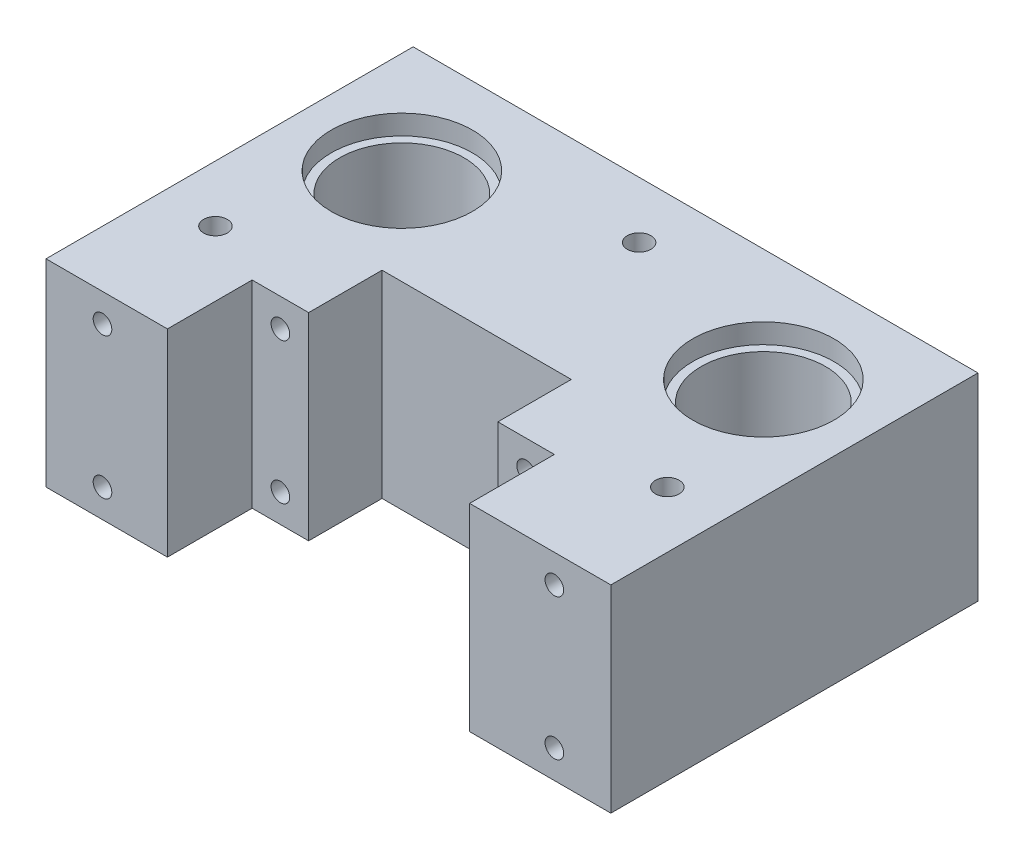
ISO-10303-21;
HEADER;
FILE_DESCRIPTION(('STEP AP214'),'2;1');
FILE_NAME('part.step','',(''),(''),'','','');
FILE_SCHEMA(('AUTOMOTIVE_DESIGN { 1 0 10303 214 1 1 1 1 }'));
ENDSEC;
DATA;
#1=APPLICATION_CONTEXT('core data for automotive mechanical design processes');
#2=APPLICATION_PROTOCOL_DEFINITION('international standard','automotive_design',2000,#1);
#3=PRODUCT_CONTEXT('',#1,'mechanical');
#4=PRODUCT('Part','Part','',(#3));
#5=PRODUCT_RELATED_PRODUCT_CATEGORY('part','',(#4));
#6=PRODUCT_DEFINITION_FORMATION('','',#4);
#7=PRODUCT_DEFINITION_CONTEXT('part definition',#1,'design');
#8=PRODUCT_DEFINITION('design','',#6,#7);
#9=PRODUCT_DEFINITION_SHAPE('','',#8);
#10=(LENGTH_UNIT() NAMED_UNIT(*) SI_UNIT(.MILLI.,.METRE.));
#11=(NAMED_UNIT(*) PLANE_ANGLE_UNIT() SI_UNIT($,.RADIAN.));
#12=(NAMED_UNIT(*) SI_UNIT($,.STERADIAN.) SOLID_ANGLE_UNIT());
#13=UNCERTAINTY_MEASURE_WITH_UNIT(LENGTH_MEASURE(1.E-05),#10,'distance_accuracy_value','');
#14=(GEOMETRIC_REPRESENTATION_CONTEXT(3) GLOBAL_UNCERTAINTY_ASSIGNED_CONTEXT((#13)) GLOBAL_UNIT_ASSIGNED_CONTEXT((#10,
#11,#12)) REPRESENTATION_CONTEXT('',''));
#15=CARTESIAN_POINT('',(0.,0.,0.));
#16=DIRECTION('',(0.,0.,1.));
#17=DIRECTION('',(1.,0.,0.));
#18=AXIS2_PLACEMENT_3D('',#15,#16,#17);
#19=CARTESIAN_POINT('',(82.,-30.,20.));
#20=DIRECTION('',(0.,1.,0.));
#21=DIRECTION('',(0.,0.,1.));
#22=AXIS2_PLACEMENT_3D('',#19,#20,#21);
#23=CYLINDRICAL_SURFACE('',#22,11.);
#24=CARTESIAN_POINT('',(82.,0.,20.));
#25=DIRECTION('',(0.,1.,0.));
#26=DIRECTION('',(0.,0.,1.));
#27=AXIS2_PLACEMENT_3D('',#24,#25,#26);
#28=CIRCLE('',#27,11.);
#29=CARTESIAN_POINT('',(82.,0.,31.));
#30=VERTEX_POINT('',#29);
#31=EDGE_CURVE('E192',#30,#30,#28,.T.);
#32=ORIENTED_EDGE('',*,*,#31,.F.);
#33=EDGE_LOOP('',(#32));
#34=FACE_BOUND('',#33,.T.);
#35=CARTESIAN_POINT('',(82.,31.5,20.));
#36=DIRECTION('',(0.,1.,0.));
#37=DIRECTION('',(0.,0.,1.));
#38=AXIS2_PLACEMENT_3D('',#35,#36,#37);
#39=CIRCLE('',#38,11.);
#40=CARTESIAN_POINT('',(82.,31.5,31.));
#41=VERTEX_POINT('',#40);
#42=EDGE_CURVE('E37',#41,#41,#39,.F.);
#43=ORIENTED_EDGE('',*,*,#42,.F.);
#44=EDGE_LOOP('',(#43));
#45=FACE_BOUND('',#44,.T.);
#46=ADVANCED_FACE('F33',(#34,#45),#23,.F.);
#47=CARTESIAN_POINT('',(18.,-30.,20.));
#48=DIRECTION('',(0.,1.,0.));
#49=DIRECTION('',(0.,0.,1.));
#50=AXIS2_PLACEMENT_3D('',#47,#48,#49);
#51=CYLINDRICAL_SURFACE('',#50,11.);
#52=CARTESIAN_POINT('',(18.,0.,20.));
#53=DIRECTION('',(0.,1.,0.));
#54=DIRECTION('',(0.,0.,1.));
#55=AXIS2_PLACEMENT_3D('',#52,#53,#54);
#56=CIRCLE('',#55,11.);
#57=CARTESIAN_POINT('',(18.,0.,31.));
#58=VERTEX_POINT('',#57);
#59=EDGE_CURVE('E195',#58,#58,#56,.T.);
#60=ORIENTED_EDGE('',*,*,#59,.F.);
#61=EDGE_LOOP('',(#60));
#62=FACE_BOUND('',#61,.T.);
#63=CARTESIAN_POINT('',(18.,31.5,20.));
#64=DIRECTION('',(0.,1.,0.));
#65=DIRECTION('',(0.,0.,1.));
#66=AXIS2_PLACEMENT_3D('',#63,#64,#65);
#67=CIRCLE('',#66,11.);
#68=CARTESIAN_POINT('',(18.,31.5,31.));
#69=VERTEX_POINT('',#68);
#70=EDGE_CURVE('E151',#69,#69,#67,.F.);
#71=ORIENTED_EDGE('',*,*,#70,.F.);
#72=EDGE_LOOP('',(#71));
#73=FACE_BOUND('',#72,.T.);
#74=ADVANCED_FACE('F255',(#62,#73),#51,.F.);
#75=CARTESIAN_POINT('',(0.,0.,65.));
#76=DIRECTION('',(0.,1.,0.));
#77=DIRECTION('',(0.,0.,1.));
#78=AXIS2_PLACEMENT_3D('',#75,#76,#77);
#79=PLANE('',#78);
#80=CARTESIAN_POINT('',(59.9975000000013,0.,32.5));
#81=DIRECTION('',(0.,-1.,0.));
#82=DIRECTION('',(0.,0.,-1.));
#83=AXIS2_PLACEMENT_3D('',#80,#81,#82);
#84=CIRCLE('',#83,1.65);
#85=CARTESIAN_POINT('',(59.9975000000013,0.,30.85));
#86=VERTEX_POINT('',#85);
#87=EDGE_CURVE('E443',#86,#86,#84,.T.);
#88=ORIENTED_EDGE('',*,*,#87,.F.);
#89=EDGE_LOOP('',(#88));
#90=FACE_BOUND('',#89,.T.);
#91=CARTESIAN_POINT('',(36.4975000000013,0.,32.5));
#92=DIRECTION('',(0.,-1.,0.));
#93=DIRECTION('',(0.,0.,-1.));
#94=AXIS2_PLACEMENT_3D('',#91,#92,#93);
#95=CIRCLE('',#94,1.65);
#96=CARTESIAN_POINT('',(36.4975000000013,0.,30.85));
#97=VERTEX_POINT('',#96);
#98=EDGE_CURVE('E442',#97,#97,#95,.T.);
#99=ORIENTED_EDGE('',*,*,#98,.F.);
#100=EDGE_LOOP('',(#99));
#101=FACE_BOUND('',#100,.T.);
#102=ORIENTED_EDGE('',*,*,#59,.T.);
#103=EDGE_LOOP('',(#102));
#104=FACE_BOUND('',#103,.T.);
#105=ORIENTED_EDGE('',*,*,#31,.T.);
#106=EDGE_LOOP('',(#105));
#107=FACE_BOUND('',#106,.T.);
#108=DIRECTION('',(-1.21199346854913E-13,0.,1.));
#109=VECTOR('',#108,1.);
#110=CARTESIAN_POINT('',(74.9974999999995,0.,65.0000000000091));
#111=LINE('',#110,#109);
#112=CARTESIAN_POINT('',(74.9975000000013,0.,50.));
#113=VERTEX_POINT('',#112);
#114=CARTESIAN_POINT('',(74.9974999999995,0.,65.));
#115=VERTEX_POINT('',#114);
#116=EDGE_CURVE('E180',#113,#115,#111,.T.);
#117=ORIENTED_EDGE('',*,*,#116,.F.);
#118=DIRECTION('',(1.,0.,0.));
#119=VECTOR('',#118,1.);
#120=CARTESIAN_POINT('',(0.,0.,50.));
#121=LINE('',#120,#119);
#122=CARTESIAN_POINT('',(64.9975000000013,0.,50.));
#123=VERTEX_POINT('',#122);
#124=EDGE_CURVE('E190',#123,#113,#121,.T.);
#125=ORIENTED_EDGE('',*,*,#124,.F.);
#126=DIRECTION('',(0.,0.,1.));
#127=VECTOR('',#126,1.);
#128=CARTESIAN_POINT('',(64.9975000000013,0.,65.));
#129=LINE('',#128,#127);
#130=CARTESIAN_POINT('',(64.9975000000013,0.,37.));
#131=VERTEX_POINT('',#130);
#132=EDGE_CURVE('E188',#131,#123,#129,.T.);
#133=ORIENTED_EDGE('',*,*,#132,.F.);
#134=DIRECTION('',(1.,0.,0.));
#135=VECTOR('',#134,1.);
#136=CARTESIAN_POINT('',(0.,0.,37.));
#137=LINE('',#136,#135);
#138=CARTESIAN_POINT('',(31.4975000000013,0.,37.));
#139=VERTEX_POINT('',#138);
#140=EDGE_CURVE('E186',#139,#131,#137,.T.);
#141=ORIENTED_EDGE('',*,*,#140,.F.);
#142=DIRECTION('',(0.,0.,-1.));
#143=VECTOR('',#142,1.);
#144=CARTESIAN_POINT('',(31.4975000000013,0.,65.));
#145=LINE('',#144,#143);
#146=CARTESIAN_POINT('',(31.4975000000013,0.,50.));
#147=VERTEX_POINT('',#146);
#148=EDGE_CURVE('E184',#147,#139,#145,.T.);
#149=ORIENTED_EDGE('',*,*,#148,.F.);
#150=DIRECTION('',(1.,0.,0.));
#151=VECTOR('',#150,1.);
#152=CARTESIAN_POINT('',(0.,0.,50.));
#153=LINE('',#152,#151);
#154=CARTESIAN_POINT('',(21.4975000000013,0.,50.));
#155=VERTEX_POINT('',#154);
#156=EDGE_CURVE('E182',#155,#147,#153,.T.);
#157=ORIENTED_EDGE('',*,*,#156,.F.);
#158=DIRECTION('',(0.,0.,-1.));
#159=VECTOR('',#158,1.);
#160=CARTESIAN_POINT('',(21.4975000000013,0.,65.));
#161=LINE('',#160,#159);
#162=CARTESIAN_POINT('',(21.4975000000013,0.,65.));
#163=VERTEX_POINT('',#162);
#164=EDGE_CURVE('E135',#163,#155,#161,.T.);
#165=ORIENTED_EDGE('',*,*,#164,.F.);
#166=DIRECTION('',(1.,0.,0.));
#167=VECTOR('',#166,1.);
#168=CARTESIAN_POINT('',(0.,0.,65.));
#169=LINE('',#168,#167);
#170=CARTESIAN_POINT('',(0.,0.,65.));
#171=VERTEX_POINT('',#170);
#172=EDGE_CURVE('E88',#171,#163,#169,.T.);
#173=ORIENTED_EDGE('',*,*,#172,.F.);
#174=DIRECTION('',(0.,0.,-1.));
#175=VECTOR('',#174,1.);
#176=CARTESIAN_POINT('',(0.,0.,65.));
#177=LINE('',#176,#175);
#178=CARTESIAN_POINT('',(0.,0.,0.));
#179=VERTEX_POINT('',#178);
#180=EDGE_CURVE('E222',#171,#179,#177,.T.);
#181=ORIENTED_EDGE('',*,*,#180,.T.);
#182=DIRECTION('',(1.,0.,0.));
#183=VECTOR('',#182,1.);
#184=CARTESIAN_POINT('',(0.,0.,0.));
#185=LINE('',#184,#183);
#186=CARTESIAN_POINT('',(100.,0.,0.));
#187=VERTEX_POINT('',#186);
#188=EDGE_CURVE('E211',#179,#187,#185,.T.);
#189=ORIENTED_EDGE('',*,*,#188,.T.);
#190=DIRECTION('',(0.,0.,-1.));
#191=VECTOR('',#190,1.);
#192=CARTESIAN_POINT('',(100.,0.,65.));
#193=LINE('',#192,#191);
#194=CARTESIAN_POINT('',(100.,0.,65.));
#195=VERTEX_POINT('',#194);
#196=EDGE_CURVE('E219',#195,#187,#193,.T.);
#197=ORIENTED_EDGE('',*,*,#196,.F.);
#198=EDGE_CURVE('E201',#115,#195,#169,.T.);
#199=ORIENTED_EDGE('',*,*,#198,.F.);
#200=EDGE_LOOP('',(#117,#125,#133,#141,#149,#157,#165,#173,#181,#189,#197,#199));
#201=FACE_BOUND('',#200,.T.);
#202=ADVANCED_FACE('F225',(#90,#101,#104,#107,#201),#79,.F.);
#203=CARTESIAN_POINT('',(0.,35.,65.));
#204=DIRECTION('',(0.,-1.,0.));
#205=DIRECTION('',(0.,0.,-1.));
#206=AXIS2_PLACEMENT_3D('',#203,#204,#205);
#207=PLANE('',#206);
#208=CARTESIAN_POINT('',(90.,35.,45.));
#209=DIRECTION('',(0.,1.,0.));
#210=DIRECTION('',(0.,0.,1.));
#211=AXIS2_PLACEMENT_3D('',#208,#209,#210);
#212=CIRCLE('',#211,2.1);
#213=CARTESIAN_POINT('',(90.,35.,47.1));
#214=VERTEX_POINT('',#213);
#215=EDGE_CURVE('E495',#214,#214,#212,.T.);
#216=ORIENTED_EDGE('',*,*,#215,.F.);
#217=EDGE_LOOP('',(#216));
#218=FACE_BOUND('',#217,.T.);
#219=CARTESIAN_POINT('',(10.,35.,45.));
#220=DIRECTION('',(0.,1.,0.));
#221=DIRECTION('',(0.,0.,1.));
#222=AXIS2_PLACEMENT_3D('',#219,#220,#221);
#223=CIRCLE('',#222,2.1);
#224=CARTESIAN_POINT('',(10.,35.,47.1));
#225=VERTEX_POINT('',#224);
#226=EDGE_CURVE('E501',#225,#225,#223,.T.);
#227=ORIENTED_EDGE('',*,*,#226,.F.);
#228=EDGE_LOOP('',(#227));
#229=FACE_BOUND('',#228,.T.);
#230=CARTESIAN_POINT('',(50.,35.,10.));
#231=DIRECTION('',(0.,1.,0.));
#232=DIRECTION('',(0.,0.,1.));
#233=AXIS2_PLACEMENT_3D('',#230,#231,#232);
#234=CIRCLE('',#233,2.1);
#235=CARTESIAN_POINT('',(50.,35.,12.1));
#236=VERTEX_POINT('',#235);
#237=EDGE_CURVE('E507',#236,#236,#234,.T.);
#238=ORIENTED_EDGE('',*,*,#237,.F.);
#239=EDGE_LOOP('',(#238));
#240=FACE_BOUND('',#239,.T.);
#241=CARTESIAN_POINT('',(82.,35.,20.));
#242=DIRECTION('',(0.,1.,0.));
#243=DIRECTION('',(0.,0.,1.));
#244=AXIS2_PLACEMENT_3D('',#241,#242,#243);
#245=CIRCLE('',#244,12.5);
#246=CARTESIAN_POINT('',(82.,35.,32.5));
#247=VERTEX_POINT('',#246);
#248=EDGE_CURVE('E513',#247,#247,#245,.T.);
#249=ORIENTED_EDGE('',*,*,#248,.F.);
#250=EDGE_LOOP('',(#249));
#251=FACE_BOUND('',#250,.T.);
#252=CARTESIAN_POINT('',(18.,35.,20.));
#253=DIRECTION('',(0.,1.,0.));
#254=DIRECTION('',(0.,0.,1.));
#255=AXIS2_PLACEMENT_3D('',#252,#253,#254);
#256=CIRCLE('',#255,12.5);
#257=CARTESIAN_POINT('',(18.,35.,32.5));
#258=VERTEX_POINT('',#257);
#259=EDGE_CURVE('E156',#258,#258,#256,.T.);
#260=ORIENTED_EDGE('',*,*,#259,.F.);
#261=EDGE_LOOP('',(#260));
#262=FACE_BOUND('',#261,.T.);
#263=DIRECTION('',(-1.21199346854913E-13,0.,1.));
#264=VECTOR('',#263,1.);
#265=CARTESIAN_POINT('',(74.9974999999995,35.,65.));
#266=LINE('',#265,#264);
#267=CARTESIAN_POINT('',(74.9975000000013,35.,50.));
#268=VERTEX_POINT('',#267);
#269=CARTESIAN_POINT('',(74.9974999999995,35.,65.));
#270=VERTEX_POINT('',#269);
#271=EDGE_CURVE('E139',#268,#270,#266,.T.);
#272=ORIENTED_EDGE('',*,*,#271,.T.);
#273=DIRECTION('',(-1.,0.,0.));
#274=VECTOR('',#273,1.);
#275=CARTESIAN_POINT('',(0.,35.,65.));
#276=LINE('',#275,#274);
#277=CARTESIAN_POINT('',(100.,35.,65.));
#278=VERTEX_POINT('',#277);
#279=EDGE_CURVE('E205',#278,#270,#276,.T.);
#280=ORIENTED_EDGE('',*,*,#279,.F.);
#281=DIRECTION('',(0.,0.,-1.));
#282=VECTOR('',#281,1.);
#283=CARTESIAN_POINT('',(100.,35.,65.));
#284=LINE('',#283,#282);
#285=CARTESIAN_POINT('',(100.,35.,0.));
#286=VERTEX_POINT('',#285);
#287=EDGE_CURVE('E217',#278,#286,#284,.T.);
#288=ORIENTED_EDGE('',*,*,#287,.T.);
#289=DIRECTION('',(-1.,0.,0.));
#290=VECTOR('',#289,1.);
#291=CARTESIAN_POINT('',(0.,35.,0.));
#292=LINE('',#291,#290);
#293=CARTESIAN_POINT('',(0.,35.,0.));
#294=VERTEX_POINT('',#293);
#295=EDGE_CURVE('E80',#286,#294,#292,.T.);
#296=ORIENTED_EDGE('',*,*,#295,.T.);
#297=DIRECTION('',(0.,0.,-1.));
#298=VECTOR('',#297,1.);
#299=CARTESIAN_POINT('',(0.,35.,65.));
#300=LINE('',#299,#298);
#301=CARTESIAN_POINT('',(0.,35.,65.));
#302=VERTEX_POINT('',#301);
#303=EDGE_CURVE('E208',#302,#294,#300,.T.);
#304=ORIENTED_EDGE('',*,*,#303,.F.);
#305=CARTESIAN_POINT('',(21.4975000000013,35.,65.));
#306=VERTEX_POINT('',#305);
#307=EDGE_CURVE('E58',#306,#302,#276,.T.);
#308=ORIENTED_EDGE('',*,*,#307,.F.);
#309=DIRECTION('',(0.,0.,-1.));
#310=VECTOR('',#309,1.);
#311=CARTESIAN_POINT('',(21.4975000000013,35.,65.));
#312=LINE('',#311,#310);
#313=CARTESIAN_POINT('',(21.4975000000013,35.,50.));
#314=VERTEX_POINT('',#313);
#315=EDGE_CURVE('E50',#306,#314,#312,.T.);
#316=ORIENTED_EDGE('',*,*,#315,.T.);
#317=DIRECTION('',(1.,0.,0.));
#318=VECTOR('',#317,1.);
#319=CARTESIAN_POINT('',(21.4975000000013,35.,50.));
#320=LINE('',#319,#318);
#321=CARTESIAN_POINT('',(31.4975000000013,35.,50.));
#322=VERTEX_POINT('',#321);
#323=EDGE_CURVE('E142',#314,#322,#320,.T.);
#324=ORIENTED_EDGE('',*,*,#323,.T.);
#325=DIRECTION('',(0.,0.,-1.));
#326=VECTOR('',#325,1.);
#327=CARTESIAN_POINT('',(31.4975000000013,35.,50.));
#328=LINE('',#327,#326);
#329=CARTESIAN_POINT('',(31.4975000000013,35.,37.));
#330=VERTEX_POINT('',#329);
#331=EDGE_CURVE('E147',#322,#330,#328,.T.);
#332=ORIENTED_EDGE('',*,*,#331,.T.);
#333=DIRECTION('',(1.,0.,0.));
#334=VECTOR('',#333,1.);
#335=CARTESIAN_POINT('',(31.4975000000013,35.,37.));
#336=LINE('',#335,#334);
#337=CARTESIAN_POINT('',(64.9975000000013,35.,37.));
#338=VERTEX_POINT('',#337);
#339=EDGE_CURVE('E160',#330,#338,#336,.T.);
#340=ORIENTED_EDGE('',*,*,#339,.T.);
#341=DIRECTION('',(0.,0.,1.));
#342=VECTOR('',#341,1.);
#343=CARTESIAN_POINT('',(64.9975000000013,35.,50.));
#344=LINE('',#343,#342);
#345=CARTESIAN_POINT('',(64.9975000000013,35.,50.));
#346=VERTEX_POINT('',#345);
#347=EDGE_CURVE('E163',#338,#346,#344,.T.);
#348=ORIENTED_EDGE('',*,*,#347,.T.);
#349=DIRECTION('',(1.,0.,0.));
#350=VECTOR('',#349,1.);
#351=CARTESIAN_POINT('',(64.9975000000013,35.,50.));
#352=LINE('',#351,#350);
#353=EDGE_CURVE('E166',#346,#268,#352,.T.);
#354=ORIENTED_EDGE('',*,*,#353,.T.);
#355=EDGE_LOOP('',(#272,#280,#288,#296,#304,#308,#316,#324,#332,#340,#348,#354));
#356=FACE_BOUND('',#355,.T.);
#357=ADVANCED_FACE('F150',(#218,#229,#240,#251,#262,#356),#207,.F.);
#358=CARTESIAN_POINT('',(0.,35.,65.));
#359=DIRECTION('',(0.,0.,-1.));
#360=DIRECTION('',(-1.,0.,0.));
#361=AXIS2_PLACEMENT_3D('',#358,#359,#360);
#362=PLANE('',#361);
#363=CARTESIAN_POINT('',(90.,5.,65.));
#364=DIRECTION('',(0.,0.,1.));
#365=DIRECTION('',(1.,0.,0.));
#366=AXIS2_PLACEMENT_3D('',#363,#364,#365);
#367=CIRCLE('',#366,1.65);
#368=CARTESIAN_POINT('',(91.65,5.,65.));
#369=VERTEX_POINT('',#368);
#370=EDGE_CURVE('E279',#369,#369,#367,.T.);
#371=ORIENTED_EDGE('',*,*,#370,.F.);
#372=EDGE_LOOP('',(#371));
#373=FACE_BOUND('',#372,.T.);
#374=CARTESIAN_POINT('',(90.,30.,65.));
#375=DIRECTION('',(0.,0.,1.));
#376=DIRECTION('',(1.,0.,0.));
#377=AXIS2_PLACEMENT_3D('',#374,#375,#376);
#378=CIRCLE('',#377,1.65);
#379=CARTESIAN_POINT('',(91.65,30.,65.));
#380=VERTEX_POINT('',#379);
#381=EDGE_CURVE('E283',#380,#380,#378,.T.);
#382=ORIENTED_EDGE('',*,*,#381,.F.);
#383=EDGE_LOOP('',(#382));
#384=FACE_BOUND('',#383,.T.);
#385=DIRECTION('',(0.,1.,0.));
#386=VECTOR('',#385,1.);
#387=CARTESIAN_POINT('',(74.9974999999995,35.,65.));
#388=LINE('',#387,#386);
#389=EDGE_CURVE('E12',#115,#270,#388,.T.);
#390=ORIENTED_EDGE('',*,*,#389,.F.);
#391=ORIENTED_EDGE('',*,*,#198,.T.);
#392=DIRECTION('',(0.,1.,0.));
#393=VECTOR('',#392,1.);
#394=CARTESIAN_POINT('',(100.,0.,65.));
#395=LINE('',#394,#393);
#396=EDGE_CURVE('E203',#195,#278,#395,.T.);
#397=ORIENTED_EDGE('',*,*,#396,.T.);
#398=ORIENTED_EDGE('',*,*,#279,.T.);
#399=EDGE_LOOP('',(#390,#391,#397,#398));
#400=FACE_BOUND('',#399,.T.);
#401=ADVANCED_FACE('F267',(#373,#384,#400),#362,.F.);
#402=CARTESIAN_POINT('',(10.,30.,65.));
#403=DIRECTION('',(0.,0.,1.));
#404=DIRECTION('',(1.,0.,0.));
#405=AXIS2_PLACEMENT_3D('',#402,#403,#404);
#406=CIRCLE('',#405,1.65);
#407=CARTESIAN_POINT('',(11.65,30.,65.));
#408=VERTEX_POINT('',#407);
#409=EDGE_CURVE('E452',#408,#408,#406,.T.);
#410=ORIENTED_EDGE('',*,*,#409,.F.);
#411=EDGE_LOOP('',(#410));
#412=FACE_BOUND('',#411,.T.);
#413=CARTESIAN_POINT('',(10.,5.,65.));
#414=DIRECTION('',(0.,0.,1.));
#415=DIRECTION('',(1.,0.,0.));
#416=AXIS2_PLACEMENT_3D('',#413,#414,#415);
#417=CIRCLE('',#416,1.65);
#418=CARTESIAN_POINT('',(11.65,5.,65.));
#419=VERTEX_POINT('',#418);
#420=EDGE_CURVE('E457',#419,#419,#417,.T.);
#421=ORIENTED_EDGE('',*,*,#420,.F.);
#422=EDGE_LOOP('',(#421));
#423=FACE_BOUND('',#422,.T.);
#424=DIRECTION('',(0.,-1.,0.));
#425=VECTOR('',#424,1.);
#426=CARTESIAN_POINT('',(21.4975000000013,35.,65.));
#427=LINE('',#426,#425);
#428=EDGE_CURVE('E42',#306,#163,#427,.T.);
#429=ORIENTED_EDGE('',*,*,#428,.F.);
#430=ORIENTED_EDGE('',*,*,#307,.T.);
#431=DIRECTION('',(0.,-1.,0.));
#432=VECTOR('',#431,1.);
#433=CARTESIAN_POINT('',(0.,0.,65.));
#434=LINE('',#433,#432);
#435=EDGE_CURVE('E199',#302,#171,#434,.T.);
#436=ORIENTED_EDGE('',*,*,#435,.T.);
#437=ORIENTED_EDGE('',*,*,#172,.T.);
#438=EDGE_LOOP('',(#429,#430,#436,#437));
#439=FACE_BOUND('',#438,.T.);
#440=ADVANCED_FACE('F227',(#412,#423,#439),#362,.F.);
#441=CARTESIAN_POINT('',(0.,0.,65.));
#442=DIRECTION('',(1.,0.,0.));
#443=DIRECTION('',(0.,0.,-1.));
#444=AXIS2_PLACEMENT_3D('',#441,#442,#443);
#445=PLANE('',#444);
#446=DIRECTION('',(0.,-1.,0.));
#447=VECTOR('',#446,1.);
#448=CARTESIAN_POINT('',(0.,0.,0.));
#449=LINE('',#448,#447);
#450=EDGE_CURVE('E198',#294,#179,#449,.T.);
#451=ORIENTED_EDGE('',*,*,#450,.T.);
#452=ORIENTED_EDGE('',*,*,#180,.F.);
#453=ORIENTED_EDGE('',*,*,#435,.F.);
#454=ORIENTED_EDGE('',*,*,#303,.T.);
#455=EDGE_LOOP('',(#451,#452,#453,#454));
#456=FACE_BOUND('',#455,.T.);
#457=ADVANCED_FACE('F35',(#456),#445,.F.);
#458=CARTESIAN_POINT('',(100.,0.,65.));
#459=DIRECTION('',(-1.,0.,0.));
#460=DIRECTION('',(0.,0.,1.));
#461=AXIS2_PLACEMENT_3D('',#458,#459,#460);
#462=PLANE('',#461);
#463=DIRECTION('',(0.,1.,0.));
#464=VECTOR('',#463,1.);
#465=CARTESIAN_POINT('',(100.,0.,0.));
#466=LINE('',#465,#464);
#467=EDGE_CURVE('E213',#187,#286,#466,.T.);
#468=ORIENTED_EDGE('',*,*,#467,.T.);
#469=ORIENTED_EDGE('',*,*,#287,.F.);
#470=ORIENTED_EDGE('',*,*,#396,.F.);
#471=ORIENTED_EDGE('',*,*,#196,.T.);
#472=EDGE_LOOP('',(#468,#469,#470,#471));
#473=FACE_BOUND('',#472,.T.);
#474=ADVANCED_FACE('F238',(#473),#462,.F.);
#475=CARTESIAN_POINT('',(0.,35.,0.));
#476=DIRECTION('',(0.,0.,-1.));
#477=DIRECTION('',(-1.,0.,0.));
#478=AXIS2_PLACEMENT_3D('',#475,#476,#477);
#479=PLANE('',#478);
#480=ORIENTED_EDGE('',*,*,#450,.F.);
#481=ORIENTED_EDGE('',*,*,#295,.F.);
#482=ORIENTED_EDGE('',*,*,#467,.F.);
#483=ORIENTED_EDGE('',*,*,#188,.F.);
#484=EDGE_LOOP('',(#480,#481,#482,#483));
#485=FACE_BOUND('',#484,.T.);
#486=ADVANCED_FACE('F240',(#485),#479,.T.);
#487=CARTESIAN_POINT('',(64.9975000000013,-30.,50.));
#488=DIRECTION('',(0.,0.,1.));
#489=DIRECTION('',(1.,0.,0.));
#490=AXIS2_PLACEMENT_3D('',#487,#488,#489);
#491=PLANE('',#490);
#492=CARTESIAN_POINT('',(69.9975000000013,5.,50.));
#493=DIRECTION('',(0.,0.,1.));
#494=DIRECTION('',(1.,0.,0.));
#495=AXIS2_PLACEMENT_3D('',#492,#493,#494);
#496=CIRCLE('',#495,1.65);
#497=CARTESIAN_POINT('',(71.6475000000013,5.,50.));
#498=VERTEX_POINT('',#497);
#499=EDGE_CURVE('E477',#498,#498,#496,.T.);
#500=ORIENTED_EDGE('',*,*,#499,.F.);
#501=EDGE_LOOP('',(#500));
#502=FACE_BOUND('',#501,.T.);
#503=CARTESIAN_POINT('',(69.9975000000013,30.,50.));
#504=DIRECTION('',(0.,0.,1.));
#505=DIRECTION('',(1.,0.,0.));
#506=AXIS2_PLACEMENT_3D('',#503,#504,#505);
#507=CIRCLE('',#506,1.65);
#508=CARTESIAN_POINT('',(71.6475000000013,30.,50.));
#509=VERTEX_POINT('',#508);
#510=EDGE_CURVE('E483',#509,#509,#507,.T.);
#511=ORIENTED_EDGE('',*,*,#510,.F.);
#512=EDGE_LOOP('',(#511));
#513=FACE_BOUND('',#512,.T.);
#514=ORIENTED_EDGE('',*,*,#124,.T.);
#515=DIRECTION('',(0.,1.,0.));
#516=VECTOR('',#515,1.);
#517=CARTESIAN_POINT('',(74.9975000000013,-30.,50.));
#518=LINE('',#517,#516);
#519=EDGE_CURVE('E170',#113,#268,#518,.T.);
#520=ORIENTED_EDGE('',*,*,#519,.T.);
#521=ORIENTED_EDGE('',*,*,#353,.F.);
#522=DIRECTION('',(0.,1.,0.));
#523=VECTOR('',#522,1.);
#524=CARTESIAN_POINT('',(64.9975000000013,-30.,50.));
#525=LINE('',#524,#523);
#526=EDGE_CURVE('E172',#123,#346,#525,.T.);
#527=ORIENTED_EDGE('',*,*,#526,.F.);
#528=EDGE_LOOP('',(#514,#520,#521,#527));
#529=FACE_BOUND('',#528,.T.);
#530=ADVANCED_FACE('F242',(#502,#513,#529),#491,.T.);
#531=CARTESIAN_POINT('',(64.9975000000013,-30.,50.));
#532=DIRECTION('',(-1.,0.,0.));
#533=DIRECTION('',(0.,0.,1.));
#534=AXIS2_PLACEMENT_3D('',#531,#532,#533);
#535=PLANE('',#534);
#536=ORIENTED_EDGE('',*,*,#132,.T.);
#537=ORIENTED_EDGE('',*,*,#526,.T.);
#538=ORIENTED_EDGE('',*,*,#347,.F.);
#539=DIRECTION('',(0.,1.,0.));
#540=VECTOR('',#539,1.);
#541=CARTESIAN_POINT('',(64.9975000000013,-30.,37.));
#542=LINE('',#541,#540);
#543=EDGE_CURVE('E174',#131,#338,#542,.T.);
#544=ORIENTED_EDGE('',*,*,#543,.F.);
#545=EDGE_LOOP('',(#536,#537,#538,#544));
#546=FACE_BOUND('',#545,.T.);
#547=ADVANCED_FACE('F248',(#546),#535,.T.);
#548=CARTESIAN_POINT('',(31.4975000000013,-30.,37.));
#549=DIRECTION('',(0.,0.,1.));
#550=DIRECTION('',(1.,0.,0.));
#551=AXIS2_PLACEMENT_3D('',#548,#549,#550);
#552=PLANE('',#551);
#553=ORIENTED_EDGE('',*,*,#140,.T.);
#554=ORIENTED_EDGE('',*,*,#543,.T.);
#555=ORIENTED_EDGE('',*,*,#339,.F.);
#556=DIRECTION('',(0.,1.,0.));
#557=VECTOR('',#556,1.);
#558=CARTESIAN_POINT('',(31.4975000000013,-30.,37.));
#559=LINE('',#558,#557);
#560=EDGE_CURVE('E176',#139,#330,#559,.T.);
#561=ORIENTED_EDGE('',*,*,#560,.F.);
#562=EDGE_LOOP('',(#553,#554,#555,#561));
#563=FACE_BOUND('',#562,.T.);
#564=ADVANCED_FACE('F301',(#563),#552,.T.);
#565=CARTESIAN_POINT('',(31.4975000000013,-30.,50.));
#566=DIRECTION('',(1.,0.,0.));
#567=DIRECTION('',(0.,0.,-1.));
#568=AXIS2_PLACEMENT_3D('',#565,#566,#567);
#569=PLANE('',#568);
#570=ORIENTED_EDGE('',*,*,#148,.T.);
#571=ORIENTED_EDGE('',*,*,#560,.T.);
#572=ORIENTED_EDGE('',*,*,#331,.F.);
#573=DIRECTION('',(0.,1.,0.));
#574=VECTOR('',#573,1.);
#575=CARTESIAN_POINT('',(31.4975000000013,-30.,50.));
#576=LINE('',#575,#574);
#577=EDGE_CURVE('E138',#147,#322,#576,.T.);
#578=ORIENTED_EDGE('',*,*,#577,.F.);
#579=EDGE_LOOP('',(#570,#571,#572,#578));
#580=FACE_BOUND('',#579,.T.);
#581=ADVANCED_FACE('F304',(#580),#569,.T.);
#582=CARTESIAN_POINT('',(21.4975000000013,-30.,50.));
#583=DIRECTION('',(0.,0.,1.));
#584=DIRECTION('',(1.,0.,0.));
#585=AXIS2_PLACEMENT_3D('',#582,#583,#584);
#586=PLANE('',#585);
#587=CARTESIAN_POINT('',(26.4975000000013,5.,50.));
#588=DIRECTION('',(0.,0.,1.));
#589=DIRECTION('',(1.,0.,0.));
#590=AXIS2_PLACEMENT_3D('',#587,#588,#589);
#591=CIRCLE('',#590,1.65);
#592=CARTESIAN_POINT('',(28.1475000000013,5.,50.));
#593=VERTEX_POINT('',#592);
#594=EDGE_CURVE('E472',#593,#593,#591,.T.);
#595=ORIENTED_EDGE('',*,*,#594,.F.);
#596=EDGE_LOOP('',(#595));
#597=FACE_BOUND('',#596,.T.);
#598=CARTESIAN_POINT('',(26.4975000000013,30.,50.));
#599=DIRECTION('',(0.,0.,1.));
#600=DIRECTION('',(1.,0.,0.));
#601=AXIS2_PLACEMENT_3D('',#598,#599,#600);
#602=CIRCLE('',#601,1.65);
#603=CARTESIAN_POINT('',(28.1475000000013,30.,50.));
#604=VERTEX_POINT('',#603);
#605=EDGE_CURVE('E489',#604,#604,#602,.T.);
#606=ORIENTED_EDGE('',*,*,#605,.F.);
#607=EDGE_LOOP('',(#606));
#608=FACE_BOUND('',#607,.T.);
#609=ORIENTED_EDGE('',*,*,#156,.T.);
#610=ORIENTED_EDGE('',*,*,#577,.T.);
#611=ORIENTED_EDGE('',*,*,#323,.F.);
#612=DIRECTION('',(0.,1.,0.));
#613=VECTOR('',#612,1.);
#614=CARTESIAN_POINT('',(21.4975000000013,-30.,50.));
#615=LINE('',#614,#613);
#616=EDGE_CURVE('E132',#155,#314,#615,.T.);
#617=ORIENTED_EDGE('',*,*,#616,.F.);
#618=EDGE_LOOP('',(#609,#610,#611,#617));
#619=FACE_BOUND('',#618,.T.);
#620=ADVANCED_FACE('F143',(#597,#608,#619),#586,.T.);
#621=CARTESIAN_POINT('',(74.9974999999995,-30.,65.));
#622=DIRECTION('',(-1.,0.,-1.21199346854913E-13));
#623=DIRECTION('',(-1.21199346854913E-13,0.,1.));
#624=AXIS2_PLACEMENT_3D('',#621,#622,#623);
#625=PLANE('',#624);
#626=ORIENTED_EDGE('',*,*,#116,.T.);
#627=ORIENTED_EDGE('',*,*,#389,.T.);
#628=ORIENTED_EDGE('',*,*,#271,.F.);
#629=ORIENTED_EDGE('',*,*,#519,.F.);
#630=EDGE_LOOP('',(#626,#627,#628,#629));
#631=FACE_BOUND('',#630,.T.);
#632=ADVANCED_FACE('F291',(#631),#625,.T.);
#633=CARTESIAN_POINT('',(21.4975000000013,-30.,65.));
#634=DIRECTION('',(1.,0.,0.));
#635=DIRECTION('',(0.,0.,-1.));
#636=AXIS2_PLACEMENT_3D('',#633,#634,#635);
#637=PLANE('',#636);
#638=ORIENTED_EDGE('',*,*,#164,.T.);
#639=ORIENTED_EDGE('',*,*,#616,.T.);
#640=ORIENTED_EDGE('',*,*,#315,.F.);
#641=ORIENTED_EDGE('',*,*,#428,.T.);
#642=EDGE_LOOP('',(#638,#639,#640,#641));
#643=FACE_BOUND('',#642,.T.);
#644=ADVANCED_FACE('F134',(#643),#637,.T.);
#645=CARTESIAN_POINT('',(18.,31.5,20.));
#646=DIRECTION('',(0.,1.,0.));
#647=DIRECTION('',(0.,0.,1.));
#648=AXIS2_PLACEMENT_3D('',#645,#646,#647);
#649=PLANE('',#648);
#650=CARTESIAN_POINT('',(18.,31.5,20.));
#651=DIRECTION('',(0.,1.,0.));
#652=DIRECTION('',(0.,0.,1.));
#653=AXIS2_PLACEMENT_3D('',#650,#651,#652);
#654=CIRCLE('',#653,12.5);
#655=CARTESIAN_POINT('',(18.,31.5,32.5));
#656=VERTEX_POINT('',#655);
#657=EDGE_CURVE('E154',#656,#656,#654,.T.);
#658=ORIENTED_EDGE('',*,*,#657,.T.);
#659=EDGE_LOOP('',(#658));
#660=FACE_BOUND('',#659,.T.);
#661=ORIENTED_EDGE('',*,*,#70,.T.);
#662=EDGE_LOOP('',(#661));
#663=FACE_BOUND('',#662,.T.);
#664=ADVANCED_FACE('F322',(#660,#663),#649,.T.);
#665=CARTESIAN_POINT('',(18.,31.5,20.));
#666=DIRECTION('',(0.,1.,0.));
#667=DIRECTION('',(0.,0.,1.));
#668=AXIS2_PLACEMENT_3D('',#665,#666,#667);
#669=CYLINDRICAL_SURFACE('',#668,12.5);
#670=ORIENTED_EDGE('',*,*,#657,.F.);
#671=EDGE_LOOP('',(#670));
#672=FACE_BOUND('',#671,.T.);
#673=ORIENTED_EDGE('',*,*,#259,.T.);
#674=EDGE_LOOP('',(#673));
#675=FACE_BOUND('',#674,.T.);
#676=ADVANCED_FACE('F318',(#672,#675),#669,.F.);
#677=CARTESIAN_POINT('',(82.,31.5,20.));
#678=DIRECTION('',(0.,1.,0.));
#679=DIRECTION('',(0.,0.,1.));
#680=AXIS2_PLACEMENT_3D('',#677,#678,#679);
#681=PLANE('',#680);
#682=CARTESIAN_POINT('',(82.,31.5,20.));
#683=DIRECTION('',(0.,1.,0.));
#684=DIRECTION('',(0.,0.,1.));
#685=AXIS2_PLACEMENT_3D('',#682,#683,#684);
#686=CIRCLE('',#685,12.5);
#687=CARTESIAN_POINT('',(82.,31.5,32.5));
#688=VERTEX_POINT('',#687);
#689=EDGE_CURVE('E516',#688,#688,#686,.T.);
#690=ORIENTED_EDGE('',*,*,#689,.T.);
#691=EDGE_LOOP('',(#690));
#692=FACE_BOUND('',#691,.T.);
#693=ORIENTED_EDGE('',*,*,#42,.T.);
#694=EDGE_LOOP('',(#693));
#695=FACE_BOUND('',#694,.T.);
#696=ADVANCED_FACE('F321',(#692,#695),#681,.T.);
#697=CARTESIAN_POINT('',(82.,31.5,20.));
#698=DIRECTION('',(0.,1.,0.));
#699=DIRECTION('',(0.,0.,1.));
#700=AXIS2_PLACEMENT_3D('',#697,#698,#699);
#701=CYLINDRICAL_SURFACE('',#700,12.5);
#702=ORIENTED_EDGE('',*,*,#689,.F.);
#703=EDGE_LOOP('',(#702));
#704=FACE_BOUND('',#703,.T.);
#705=ORIENTED_EDGE('',*,*,#248,.T.);
#706=EDGE_LOOP('',(#705));
#707=FACE_BOUND('',#706,.T.);
#708=ADVANCED_FACE('F327',(#704,#707),#701,.F.);
#709=CARTESIAN_POINT('',(50.,20.,10.));
#710=DIRECTION('',(0.,1.,0.));
#711=DIRECTION('',(0.,0.,1.));
#712=AXIS2_PLACEMENT_3D('',#709,#710,#711);
#713=CYLINDRICAL_SURFACE('',#712,2.1);
#714=CARTESIAN_POINT('',(50.,20.,10.));
#715=DIRECTION('',(0.,1.,0.));
#716=DIRECTION('',(0.,0.,1.));
#717=AXIS2_PLACEMENT_3D('',#714,#715,#716);
#718=CIRCLE('',#717,2.1);
#719=CARTESIAN_POINT('',(50.,20.,12.1));
#720=VERTEX_POINT('',#719);
#721=EDGE_CURVE('E510',#720,#720,#718,.T.);
#722=ORIENTED_EDGE('',*,*,#721,.F.);
#723=EDGE_LOOP('',(#722));
#724=FACE_BOUND('',#723,.T.);
#725=ORIENTED_EDGE('',*,*,#237,.T.);
#726=EDGE_LOOP('',(#725));
#727=FACE_BOUND('',#726,.T.);
#728=ADVANCED_FACE('F330',(#724,#727),#713,.F.);
#729=CARTESIAN_POINT('',(50.,20.,10.));
#730=DIRECTION('',(0.,1.,0.));
#731=DIRECTION('',(0.,0.,1.));
#732=AXIS2_PLACEMENT_3D('',#729,#730,#731);
#733=PLANE('',#732);
#734=ORIENTED_EDGE('',*,*,#721,.T.);
#735=EDGE_LOOP('',(#734));
#736=FACE_BOUND('',#735,.T.);
#737=ADVANCED_FACE('F337',(#736),#733,.T.);
#738=CARTESIAN_POINT('',(10.,20.,45.));
#739=DIRECTION('',(0.,1.,0.));
#740=DIRECTION('',(0.,0.,1.));
#741=AXIS2_PLACEMENT_3D('',#738,#739,#740);
#742=CYLINDRICAL_SURFACE('',#741,2.1);
#743=CARTESIAN_POINT('',(10.,20.,45.));
#744=DIRECTION('',(0.,1.,0.));
#745=DIRECTION('',(0.,0.,1.));
#746=AXIS2_PLACEMENT_3D('',#743,#744,#745);
#747=CIRCLE('',#746,2.1);
#748=CARTESIAN_POINT('',(10.,20.,47.1));
#749=VERTEX_POINT('',#748);
#750=EDGE_CURVE('E504',#749,#749,#747,.T.);
#751=ORIENTED_EDGE('',*,*,#750,.F.);
#752=EDGE_LOOP('',(#751));
#753=FACE_BOUND('',#752,.T.);
#754=ORIENTED_EDGE('',*,*,#226,.T.);
#755=EDGE_LOOP('',(#754));
#756=FACE_BOUND('',#755,.T.);
#757=ADVANCED_FACE('F341',(#753,#756),#742,.F.);
#758=CARTESIAN_POINT('',(10.,20.,45.));
#759=DIRECTION('',(0.,1.,0.));
#760=DIRECTION('',(0.,0.,1.));
#761=AXIS2_PLACEMENT_3D('',#758,#759,#760);
#762=PLANE('',#761);
#763=ORIENTED_EDGE('',*,*,#750,.T.);
#764=EDGE_LOOP('',(#763));
#765=FACE_BOUND('',#764,.T.);
#766=ADVANCED_FACE('F345',(#765),#762,.T.);
#767=CARTESIAN_POINT('',(90.,20.,45.));
#768=DIRECTION('',(0.,1.,0.));
#769=DIRECTION('',(0.,0.,1.));
#770=AXIS2_PLACEMENT_3D('',#767,#768,#769);
#771=CYLINDRICAL_SURFACE('',#770,2.1);
#772=CARTESIAN_POINT('',(90.,20.,45.));
#773=DIRECTION('',(0.,1.,0.));
#774=DIRECTION('',(0.,0.,1.));
#775=AXIS2_PLACEMENT_3D('',#772,#773,#774);
#776=CIRCLE('',#775,2.1);
#777=CARTESIAN_POINT('',(90.,20.,47.1));
#778=VERTEX_POINT('',#777);
#779=EDGE_CURVE('E498',#778,#778,#776,.T.);
#780=ORIENTED_EDGE('',*,*,#779,.F.);
#781=EDGE_LOOP('',(#780));
#782=FACE_BOUND('',#781,.T.);
#783=ORIENTED_EDGE('',*,*,#215,.T.);
#784=EDGE_LOOP('',(#783));
#785=FACE_BOUND('',#784,.T.);
#786=ADVANCED_FACE('F349',(#782,#785),#771,.F.);
#787=CARTESIAN_POINT('',(90.,20.,45.));
#788=DIRECTION('',(0.,1.,0.));
#789=DIRECTION('',(0.,0.,1.));
#790=AXIS2_PLACEMENT_3D('',#787,#788,#789);
#791=PLANE('',#790);
#792=ORIENTED_EDGE('',*,*,#779,.T.);
#793=EDGE_LOOP('',(#792));
#794=FACE_BOUND('',#793,.T.);
#795=ADVANCED_FACE('F353',(#794),#791,.T.);
#796=CARTESIAN_POINT('',(26.4975000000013,30.,35.));
#797=DIRECTION('',(0.,0.,1.));
#798=DIRECTION('',(1.,0.,0.));
#799=AXIS2_PLACEMENT_3D('',#796,#797,#798);
#800=CYLINDRICAL_SURFACE('',#799,1.65);
#801=CARTESIAN_POINT('',(26.4975000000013,30.,35.));
#802=DIRECTION('',(0.,0.,1.));
#803=DIRECTION('',(1.,0.,0.));
#804=AXIS2_PLACEMENT_3D('',#801,#802,#803);
#805=CIRCLE('',#804,1.65);
#806=CARTESIAN_POINT('',(28.1475000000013,30.,35.));
#807=VERTEX_POINT('',#806);
#808=EDGE_CURVE('E492',#807,#807,#805,.T.);
#809=ORIENTED_EDGE('',*,*,#808,.F.);
#810=EDGE_LOOP('',(#809));
#811=FACE_BOUND('',#810,.T.);
#812=ORIENTED_EDGE('',*,*,#605,.T.);
#813=EDGE_LOOP('',(#812));
#814=FACE_BOUND('',#813,.T.);
#815=ADVANCED_FACE('F357',(#811,#814),#800,.F.);
#816=CARTESIAN_POINT('',(26.4975000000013,30.,35.));
#817=DIRECTION('',(0.,0.,1.));
#818=DIRECTION('',(1.,0.,0.));
#819=AXIS2_PLACEMENT_3D('',#816,#817,#818);
#820=PLANE('',#819);
#821=ORIENTED_EDGE('',*,*,#808,.T.);
#822=EDGE_LOOP('',(#821));
#823=FACE_BOUND('',#822,.T.);
#824=ADVANCED_FACE('F361',(#823),#820,.T.);
#825=CARTESIAN_POINT('',(69.9975000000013,30.,35.));
#826=DIRECTION('',(0.,0.,1.));
#827=DIRECTION('',(1.,0.,0.));
#828=AXIS2_PLACEMENT_3D('',#825,#826,#827);
#829=CYLINDRICAL_SURFACE('',#828,1.65);
#830=CARTESIAN_POINT('',(69.9975000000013,30.,35.));
#831=DIRECTION('',(0.,0.,1.));
#832=DIRECTION('',(1.,0.,0.));
#833=AXIS2_PLACEMENT_3D('',#830,#831,#832);
#834=CIRCLE('',#833,1.65);
#835=CARTESIAN_POINT('',(71.6475000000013,30.,35.));
#836=VERTEX_POINT('',#835);
#837=EDGE_CURVE('E486',#836,#836,#834,.T.);
#838=ORIENTED_EDGE('',*,*,#837,.F.);
#839=EDGE_LOOP('',(#838));
#840=FACE_BOUND('',#839,.T.);
#841=ORIENTED_EDGE('',*,*,#510,.T.);
#842=EDGE_LOOP('',(#841));
#843=FACE_BOUND('',#842,.T.);
#844=ADVANCED_FACE('F365',(#840,#843),#829,.F.);
#845=CARTESIAN_POINT('',(69.9975000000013,30.,35.));
#846=DIRECTION('',(0.,0.,1.));
#847=DIRECTION('',(1.,0.,0.));
#848=AXIS2_PLACEMENT_3D('',#845,#846,#847);
#849=PLANE('',#848);
#850=ORIENTED_EDGE('',*,*,#837,.T.);
#851=EDGE_LOOP('',(#850));
#852=FACE_BOUND('',#851,.T.);
#853=ADVANCED_FACE('F369',(#852),#849,.T.);
#854=CARTESIAN_POINT('',(69.9975000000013,5.,35.));
#855=DIRECTION('',(0.,0.,1.));
#856=DIRECTION('',(1.,0.,0.));
#857=AXIS2_PLACEMENT_3D('',#854,#855,#856);
#858=CYLINDRICAL_SURFACE('',#857,1.65);
#859=CARTESIAN_POINT('',(69.9975000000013,5.,35.));
#860=DIRECTION('',(0.,0.,1.));
#861=DIRECTION('',(1.,0.,0.));
#862=AXIS2_PLACEMENT_3D('',#859,#860,#861);
#863=CIRCLE('',#862,1.65);
#864=CARTESIAN_POINT('',(71.6475000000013,5.,35.));
#865=VERTEX_POINT('',#864);
#866=EDGE_CURVE('E480',#865,#865,#863,.T.);
#867=ORIENTED_EDGE('',*,*,#866,.F.);
#868=EDGE_LOOP('',(#867));
#869=FACE_BOUND('',#868,.T.);
#870=ORIENTED_EDGE('',*,*,#499,.T.);
#871=EDGE_LOOP('',(#870));
#872=FACE_BOUND('',#871,.T.);
#873=ADVANCED_FACE('F373',(#869,#872),#858,.F.);
#874=CARTESIAN_POINT('',(69.9975000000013,5.,35.));
#875=DIRECTION('',(0.,0.,1.));
#876=DIRECTION('',(1.,0.,0.));
#877=AXIS2_PLACEMENT_3D('',#874,#875,#876);
#878=PLANE('',#877);
#879=ORIENTED_EDGE('',*,*,#866,.T.);
#880=EDGE_LOOP('',(#879));
#881=FACE_BOUND('',#880,.T.);
#882=ADVANCED_FACE('F377',(#881),#878,.T.);
#883=CARTESIAN_POINT('',(26.4975000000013,5.,35.));
#884=DIRECTION('',(0.,0.,1.));
#885=DIRECTION('',(1.,0.,0.));
#886=AXIS2_PLACEMENT_3D('',#883,#884,#885);
#887=CYLINDRICAL_SURFACE('',#886,1.65);
#888=CARTESIAN_POINT('',(26.4975000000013,5.,35.));
#889=DIRECTION('',(0.,0.,1.));
#890=DIRECTION('',(1.,0.,0.));
#891=AXIS2_PLACEMENT_3D('',#888,#889,#890);
#892=CIRCLE('',#891,1.65);
#893=CARTESIAN_POINT('',(28.1475000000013,5.,35.));
#894=VERTEX_POINT('',#893);
#895=EDGE_CURVE('E474',#894,#894,#892,.T.);
#896=ORIENTED_EDGE('',*,*,#895,.F.);
#897=EDGE_LOOP('',(#896));
#898=FACE_BOUND('',#897,.T.);
#899=ORIENTED_EDGE('',*,*,#594,.T.);
#900=EDGE_LOOP('',(#899));
#901=FACE_BOUND('',#900,.T.);
#902=ADVANCED_FACE('F381',(#898,#901),#887,.F.);
#903=CARTESIAN_POINT('',(26.4975000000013,5.,35.));
#904=DIRECTION('',(0.,0.,1.));
#905=DIRECTION('',(1.,0.,0.));
#906=AXIS2_PLACEMENT_3D('',#903,#904,#905);
#907=PLANE('',#906);
#908=ORIENTED_EDGE('',*,*,#895,.T.);
#909=EDGE_LOOP('',(#908));
#910=FACE_BOUND('',#909,.T.);
#911=ADVANCED_FACE('F385',(#910),#907,.T.);
#912=CARTESIAN_POINT('',(90.,30.,50.));
#913=DIRECTION('',(0.,0.,1.));
#914=DIRECTION('',(1.,0.,0.));
#915=AXIS2_PLACEMENT_3D('',#912,#913,#914);
#916=CYLINDRICAL_SURFACE('',#915,1.65);
#917=CARTESIAN_POINT('',(90.,30.,50.));
#918=DIRECTION('',(0.,0.,1.));
#919=DIRECTION('',(1.,0.,0.));
#920=AXIS2_PLACEMENT_3D('',#917,#918,#919);
#921=CIRCLE('',#920,1.65);
#922=CARTESIAN_POINT('',(91.65,30.,50.));
#923=VERTEX_POINT('',#922);
#924=EDGE_CURVE('E469',#923,#923,#921,.T.);
#925=ORIENTED_EDGE('',*,*,#924,.F.);
#926=EDGE_LOOP('',(#925));
#927=FACE_BOUND('',#926,.T.);
#928=ORIENTED_EDGE('',*,*,#381,.T.);
#929=EDGE_LOOP('',(#928));
#930=FACE_BOUND('',#929,.T.);
#931=ADVANCED_FACE('F389',(#927,#930),#916,.F.);
#932=CARTESIAN_POINT('',(90.,30.,50.));
#933=DIRECTION('',(0.,0.,1.));
#934=DIRECTION('',(1.,0.,0.));
#935=AXIS2_PLACEMENT_3D('',#932,#933,#934);
#936=PLANE('',#935);
#937=ORIENTED_EDGE('',*,*,#924,.T.);
#938=EDGE_LOOP('',(#937));
#939=FACE_BOUND('',#938,.T.);
#940=ADVANCED_FACE('F393',(#939),#936,.T.);
#941=CARTESIAN_POINT('',(90.,5.,50.));
#942=DIRECTION('',(0.,0.,1.));
#943=DIRECTION('',(1.,0.,0.));
#944=AXIS2_PLACEMENT_3D('',#941,#942,#943);
#945=CYLINDRICAL_SURFACE('',#944,1.65);
#946=CARTESIAN_POINT('',(90.,5.,50.));
#947=DIRECTION('',(0.,0.,1.));
#948=DIRECTION('',(1.,0.,0.));
#949=AXIS2_PLACEMENT_3D('',#946,#947,#948);
#950=CIRCLE('',#949,1.65);
#951=CARTESIAN_POINT('',(91.65,5.,50.));
#952=VERTEX_POINT('',#951);
#953=EDGE_CURVE('E465',#952,#952,#950,.T.);
#954=ORIENTED_EDGE('',*,*,#953,.F.);
#955=EDGE_LOOP('',(#954));
#956=FACE_BOUND('',#955,.T.);
#957=ORIENTED_EDGE('',*,*,#370,.T.);
#958=EDGE_LOOP('',(#957));
#959=FACE_BOUND('',#958,.T.);
#960=ADVANCED_FACE('F397',(#956,#959),#945,.F.);
#961=CARTESIAN_POINT('',(90.,5.,50.));
#962=DIRECTION('',(0.,0.,1.));
#963=DIRECTION('',(1.,0.,0.));
#964=AXIS2_PLACEMENT_3D('',#961,#962,#963);
#965=PLANE('',#964);
#966=ORIENTED_EDGE('',*,*,#953,.T.);
#967=EDGE_LOOP('',(#966));
#968=FACE_BOUND('',#967,.T.);
#969=ADVANCED_FACE('F401',(#968),#965,.T.);
#970=CARTESIAN_POINT('',(10.,5.,50.));
#971=DIRECTION('',(0.,0.,1.));
#972=DIRECTION('',(1.,0.,0.));
#973=AXIS2_PLACEMENT_3D('',#970,#971,#972);
#974=CYLINDRICAL_SURFACE('',#973,1.65);
#975=CARTESIAN_POINT('',(10.,5.,50.));
#976=DIRECTION('',(0.,0.,1.));
#977=DIRECTION('',(1.,0.,0.));
#978=AXIS2_PLACEMENT_3D('',#975,#976,#977);
#979=CIRCLE('',#978,1.65);
#980=CARTESIAN_POINT('',(11.65,5.,50.));
#981=VERTEX_POINT('',#980);
#982=EDGE_CURVE('E460',#981,#981,#979,.T.);
#983=ORIENTED_EDGE('',*,*,#982,.F.);
#984=EDGE_LOOP('',(#983));
#985=FACE_BOUND('',#984,.T.);
#986=ORIENTED_EDGE('',*,*,#420,.T.);
#987=EDGE_LOOP('',(#986));
#988=FACE_BOUND('',#987,.T.);
#989=ADVANCED_FACE('F405',(#985,#988),#974,.F.);
#990=CARTESIAN_POINT('',(10.,5.,50.));
#991=DIRECTION('',(0.,0.,1.));
#992=DIRECTION('',(1.,0.,0.));
#993=AXIS2_PLACEMENT_3D('',#990,#991,#992);
#994=PLANE('',#993);
#995=ORIENTED_EDGE('',*,*,#982,.T.);
#996=EDGE_LOOP('',(#995));
#997=FACE_BOUND('',#996,.T.);
#998=ADVANCED_FACE('F409',(#997),#994,.T.);
#999=CARTESIAN_POINT('',(10.,30.,50.));
#1000=DIRECTION('',(0.,0.,1.));
#1001=DIRECTION('',(1.,0.,0.));
#1002=AXIS2_PLACEMENT_3D('',#999,#1000,#1001);
#1003=CYLINDRICAL_SURFACE('',#1002,1.65);
#1004=CARTESIAN_POINT('',(10.,30.,50.));
#1005=DIRECTION('',(0.,0.,1.));
#1006=DIRECTION('',(1.,0.,0.));
#1007=AXIS2_PLACEMENT_3D('',#1004,#1005,#1006);
#1008=CIRCLE('',#1007,1.65);
#1009=CARTESIAN_POINT('',(11.65,30.,50.));
#1010=VERTEX_POINT('',#1009);
#1011=EDGE_CURVE('E454',#1010,#1010,#1008,.T.);
#1012=ORIENTED_EDGE('',*,*,#1011,.F.);
#1013=EDGE_LOOP('',(#1012));
#1014=FACE_BOUND('',#1013,.T.);
#1015=ORIENTED_EDGE('',*,*,#409,.T.);
#1016=EDGE_LOOP('',(#1015));
#1017=FACE_BOUND('',#1016,.T.);
#1018=ADVANCED_FACE('F413',(#1014,#1017),#1003,.F.);
#1019=CARTESIAN_POINT('',(10.,30.,50.));
#1020=DIRECTION('',(0.,0.,1.));
#1021=DIRECTION('',(1.,0.,0.));
#1022=AXIS2_PLACEMENT_3D('',#1019,#1020,#1021);
#1023=PLANE('',#1022);
#1024=ORIENTED_EDGE('',*,*,#1011,.T.);
#1025=EDGE_LOOP('',(#1024));
#1026=FACE_BOUND('',#1025,.T.);
#1027=ADVANCED_FACE('F417',(#1026),#1023,.T.);
#1028=CARTESIAN_POINT('',(36.4975000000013,15.,32.5));
#1029=DIRECTION('',(0.,-1.,0.));
#1030=DIRECTION('',(0.,0.,-1.));
#1031=AXIS2_PLACEMENT_3D('',#1028,#1029,#1030);
#1032=CYLINDRICAL_SURFACE('',#1031,1.65);
#1033=CARTESIAN_POINT('',(36.4975000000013,15.,32.5));
#1034=DIRECTION('',(0.,-1.,0.));
#1035=DIRECTION('',(0.,0.,-1.));
#1036=AXIS2_PLACEMENT_3D('',#1033,#1034,#1035);
#1037=CIRCLE('',#1036,1.65);
#1038=CARTESIAN_POINT('',(36.4975000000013,15.,30.85));
#1039=VERTEX_POINT('',#1038);
#1040=EDGE_CURVE('E446',#1039,#1039,#1037,.T.);
#1041=ORIENTED_EDGE('',*,*,#1040,.F.);
#1042=EDGE_LOOP('',(#1041));
#1043=FACE_BOUND('',#1042,.T.);
#1044=ORIENTED_EDGE('',*,*,#98,.T.);
#1045=EDGE_LOOP('',(#1044));
#1046=FACE_BOUND('',#1045,.T.);
#1047=ADVANCED_FACE('F421',(#1043,#1046),#1032,.F.);
#1048=CARTESIAN_POINT('',(36.4975000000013,15.,32.5));
#1049=DIRECTION('',(0.,-1.,0.));
#1050=DIRECTION('',(0.,0.,-1.));
#1051=AXIS2_PLACEMENT_3D('',#1048,#1049,#1050);
#1052=PLANE('',#1051);
#1053=ORIENTED_EDGE('',*,*,#1040,.T.);
#1054=EDGE_LOOP('',(#1053));
#1055=FACE_BOUND('',#1054,.T.);
#1056=ADVANCED_FACE('F425',(#1055),#1052,.T.);
#1057=CARTESIAN_POINT('',(59.9975000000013,15.,32.5));
#1058=DIRECTION('',(0.,-1.,0.));
#1059=DIRECTION('',(0.,0.,-1.));
#1060=AXIS2_PLACEMENT_3D('',#1057,#1058,#1059);
#1061=CYLINDRICAL_SURFACE('',#1060,1.65);
#1062=CARTESIAN_POINT('',(59.9975000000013,15.,32.5));
#1063=DIRECTION('',(0.,-1.,0.));
#1064=DIRECTION('',(0.,0.,-1.));
#1065=AXIS2_PLACEMENT_3D('',#1062,#1063,#1064);
#1066=CIRCLE('',#1065,1.65);
#1067=CARTESIAN_POINT('',(59.9975000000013,15.,30.85));
#1068=VERTEX_POINT('',#1067);
#1069=EDGE_CURVE('E441',#1068,#1068,#1066,.T.);
#1070=ORIENTED_EDGE('',*,*,#1069,.F.);
#1071=EDGE_LOOP('',(#1070));
#1072=FACE_BOUND('',#1071,.T.);
#1073=ORIENTED_EDGE('',*,*,#87,.T.);
#1074=EDGE_LOOP('',(#1073));
#1075=FACE_BOUND('',#1074,.T.);
#1076=ADVANCED_FACE('F429',(#1072,#1075),#1061,.F.);
#1077=CARTESIAN_POINT('',(59.9975000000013,15.,32.5));
#1078=DIRECTION('',(0.,-1.,0.));
#1079=DIRECTION('',(0.,0.,-1.));
#1080=AXIS2_PLACEMENT_3D('',#1077,#1078,#1079);
#1081=PLANE('',#1080);
#1082=ORIENTED_EDGE('',*,*,#1069,.T.);
#1083=EDGE_LOOP('',(#1082));
#1084=FACE_BOUND('',#1083,.T.);
#1085=ADVANCED_FACE('F433',(#1084),#1081,.T.);
#1086=CLOSED_SHELL('',(#46,#74,#202,#357,#401,#440,#457,#474,#486,#530,#547,#564,#581,#620,#632,
#644,#664,#676,#696,#708,#728,#737,#757,#766,#786,#795,#815,#824,#844,#853,#873,#882,#902,#911,
#931,#940,#960,#969,#989,#998,#1018,#1027,#1047,#1056,#1076,#1085));
#1087=MANIFOLD_SOLID_BREP('B2',#1086);
#1088=ADVANCED_BREP_SHAPE_REPRESENTATION('',(#18,#1087),#14);
#1089=SHAPE_DEFINITION_REPRESENTATION(#9,#1088);
ENDSEC;
END-ISO-10303-21;
